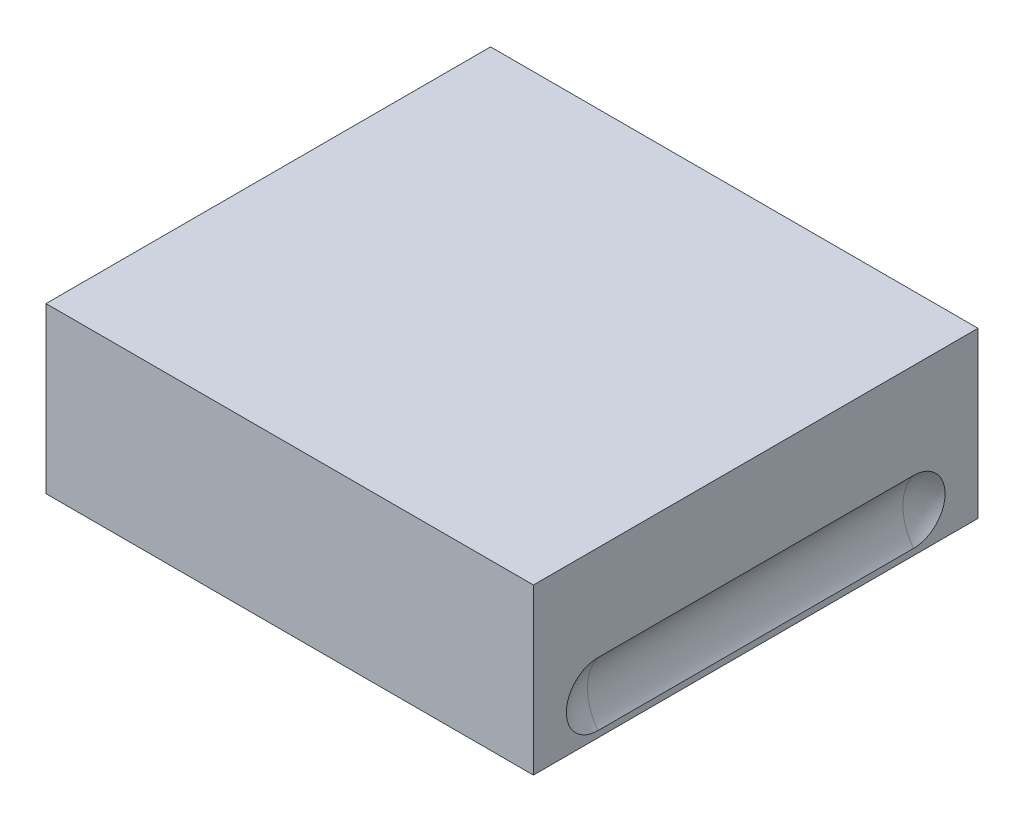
ISO-10303-21;
HEADER;
FILE_DESCRIPTION(('STEP AP214'),'2;1');
FILE_NAME('part.step','',(''),(''),'','','');
FILE_SCHEMA(('AUTOMOTIVE_DESIGN { 1 0 10303 214 1 1 1 1 }'));
ENDSEC;
DATA;
#1=APPLICATION_CONTEXT('core data for automotive mechanical design processes');
#2=APPLICATION_PROTOCOL_DEFINITION('international standard','automotive_design',2000,#1);
#3=PRODUCT_CONTEXT('',#1,'mechanical');
#4=PRODUCT('Part','Part','',(#3));
#5=PRODUCT_RELATED_PRODUCT_CATEGORY('part','',(#4));
#6=PRODUCT_DEFINITION_FORMATION('','',#4);
#7=PRODUCT_DEFINITION_CONTEXT('part definition',#1,'design');
#8=PRODUCT_DEFINITION('design','',#6,#7);
#9=PRODUCT_DEFINITION_SHAPE('','',#8);
#10=(LENGTH_UNIT() NAMED_UNIT(*) SI_UNIT(.MILLI.,.METRE.));
#11=(NAMED_UNIT(*) PLANE_ANGLE_UNIT() SI_UNIT($,.RADIAN.));
#12=(NAMED_UNIT(*) SI_UNIT($,.STERADIAN.) SOLID_ANGLE_UNIT());
#13=UNCERTAINTY_MEASURE_WITH_UNIT(LENGTH_MEASURE(1.E-05),#10,'distance_accuracy_value','');
#14=(GEOMETRIC_REPRESENTATION_CONTEXT(3) GLOBAL_UNCERTAINTY_ASSIGNED_CONTEXT((#13)) GLOBAL_UNIT_ASSIGNED_CONTEXT((#10,
#11,#12)) REPRESENTATION_CONTEXT('',''));
#15=CARTESIAN_POINT('',(0.,0.,0.));
#16=DIRECTION('',(0.,0.,1.));
#17=DIRECTION('',(1.,0.,0.));
#18=AXIS2_PLACEMENT_3D('',#15,#16,#17);
#19=CARTESIAN_POINT('',(0.,82.,-122.5));
#20=DIRECTION('',(0.,1.,0.));
#21=DIRECTION('',(0.,0.,1.));
#22=AXIS2_PLACEMENT_3D('',#19,#20,#21);
#23=PLANE('',#22);
#24=DIRECTION('',(1.,0.,0.));
#25=VECTOR('',#24,1.);
#26=CARTESIAN_POINT('',(23.5,82.,-81.5));
#27=LINE('',#26,#25);
#28=CARTESIAN_POINT('',(23.5,82.,-81.5));
#29=VERTEX_POINT('',#28);
#30=CARTESIAN_POINT('',(-23.5,82.,-81.5));
#31=VERTEX_POINT('',#30);
#32=EDGE_CURVE('E272',#29,#31,#27,.F.);
#33=ORIENTED_EDGE('',*,*,#32,.T.);
#34=DIRECTION('',(0.,0.,1.));
#35=VECTOR('',#34,1.);
#36=CARTESIAN_POINT('',(-23.5,82.,-81.5));
#37=LINE('',#36,#35);
#38=CARTESIAN_POINT('',(-23.5,82.,-163.5));
#39=VERTEX_POINT('',#38);
#40=EDGE_CURVE('E271',#31,#39,#37,.F.);
#41=ORIENTED_EDGE('',*,*,#40,.T.);
#42=DIRECTION('',(-1.,0.,0.));
#43=VECTOR('',#42,1.);
#44=CARTESIAN_POINT('',(-23.5,82.,-163.5));
#45=LINE('',#44,#43);
#46=CARTESIAN_POINT('',(23.5,82.,-163.5));
#47=VERTEX_POINT('',#46);
#48=EDGE_CURVE('E279',#39,#47,#45,.F.);
#49=ORIENTED_EDGE('',*,*,#48,.T.);
#50=DIRECTION('',(0.,0.,-1.));
#51=VECTOR('',#50,1.);
#52=CARTESIAN_POINT('',(23.5,82.,-163.5));
#53=LINE('',#52,#51);
#54=EDGE_CURVE('E80',#47,#29,#53,.F.);
#55=ORIENTED_EDGE('',*,*,#54,.T.);
#56=EDGE_LOOP('',(#33,#41,#49,#55));
#57=FACE_BOUND('',#56,.T.);
#58=ADVANCED_FACE('F14',(#57),#23,.F.);
#59=CARTESIAN_POINT('',(23.5,70.,-81.5));
#60=DIRECTION('',(0.,0.,1.));
#61=DIRECTION('',(1.,0.,0.));
#62=AXIS2_PLACEMENT_3D('',#59,#60,#61);
#63=PLANE('',#62);
#64=DIRECTION('',(0.,1.,0.));
#65=VECTOR('',#64,1.);
#66=CARTESIAN_POINT('',(23.5,70.,-81.5));
#67=LINE('',#66,#65);
#68=CARTESIAN_POINT('',(23.5,70.,-81.5));
#69=VERTEX_POINT('',#68);
#70=EDGE_CURVE('E250',#29,#69,#67,.F.);
#71=ORIENTED_EDGE('',*,*,#70,.T.);
#72=DIRECTION('',(1.,0.,0.));
#73=VECTOR('',#72,1.);
#74=CARTESIAN_POINT('',(0.,70.,-81.5));
#75=LINE('',#74,#73);
#76=CARTESIAN_POINT('',(-23.5,70.,-81.5));
#77=VERTEX_POINT('',#76);
#78=EDGE_CURVE('E218',#69,#77,#75,.F.);
#79=ORIENTED_EDGE('',*,*,#78,.T.);
#80=DIRECTION('',(0.,1.,0.));
#81=VECTOR('',#80,1.);
#82=CARTESIAN_POINT('',(-23.5,70.,-81.5));
#83=LINE('',#82,#81);
#84=EDGE_CURVE('E263',#77,#31,#83,.T.);
#85=ORIENTED_EDGE('',*,*,#84,.T.);
#86=ORIENTED_EDGE('',*,*,#32,.F.);
#87=EDGE_LOOP('',(#71,#79,#85,#86));
#88=FACE_BOUND('',#87,.T.);
#89=ADVANCED_FACE('F260',(#88),#63,.F.);
#90=CARTESIAN_POINT('',(-23.5,70.,-81.5));
#91=DIRECTION('',(-1.,0.,0.));
#92=DIRECTION('',(0.,0.,1.));
#93=AXIS2_PLACEMENT_3D('',#90,#91,#92);
#94=PLANE('',#93);
#95=ORIENTED_EDGE('',*,*,#84,.F.);
#96=DIRECTION('',(0.,0.,1.));
#97=VECTOR('',#96,1.);
#98=CARTESIAN_POINT('',(-23.5,70.,-122.5));
#99=LINE('',#98,#97);
#100=CARTESIAN_POINT('',(-23.5,70.,-163.5));
#101=VERTEX_POINT('',#100);
#102=EDGE_CURVE('E221',#77,#101,#99,.F.);
#103=ORIENTED_EDGE('',*,*,#102,.T.);
#104=DIRECTION('',(0.,1.,0.));
#105=VECTOR('',#104,1.);
#106=CARTESIAN_POINT('',(-23.5,70.,-163.5));
#107=LINE('',#106,#105);
#108=EDGE_CURVE('E274',#101,#39,#107,.T.);
#109=ORIENTED_EDGE('',*,*,#108,.T.);
#110=ORIENTED_EDGE('',*,*,#40,.F.);
#111=EDGE_LOOP('',(#95,#103,#109,#110));
#112=FACE_BOUND('',#111,.T.);
#113=ADVANCED_FACE('F268',(#112),#94,.F.);
#114=CARTESIAN_POINT('',(-23.5,70.,-163.5));
#115=DIRECTION('',(0.,0.,-1.));
#116=DIRECTION('',(-1.,0.,0.));
#117=AXIS2_PLACEMENT_3D('',#114,#115,#116);
#118=PLANE('',#117);
#119=ORIENTED_EDGE('',*,*,#108,.F.);
#120=DIRECTION('',(1.,0.,0.));
#121=VECTOR('',#120,1.);
#122=CARTESIAN_POINT('',(0.,70.,-163.5));
#123=LINE('',#122,#121);
#124=CARTESIAN_POINT('',(23.5,70.,-163.5));
#125=VERTEX_POINT('',#124);
#126=EDGE_CURVE('E233',#101,#125,#123,.T.);
#127=ORIENTED_EDGE('',*,*,#126,.T.);
#128=DIRECTION('',(0.,1.,0.));
#129=VECTOR('',#128,1.);
#130=CARTESIAN_POINT('',(23.5,70.,-163.5));
#131=LINE('',#130,#129);
#132=EDGE_CURVE('E251',#125,#47,#131,.T.);
#133=ORIENTED_EDGE('',*,*,#132,.T.);
#134=ORIENTED_EDGE('',*,*,#48,.F.);
#135=EDGE_LOOP('',(#119,#127,#133,#134));
#136=FACE_BOUND('',#135,.T.);
#137=ADVANCED_FACE('F288',(#136),#118,.F.);
#138=CARTESIAN_POINT('',(23.5,70.,-163.5));
#139=DIRECTION('',(1.,0.,0.));
#140=DIRECTION('',(0.,0.,-1.));
#141=AXIS2_PLACEMENT_3D('',#138,#139,#140);
#142=PLANE('',#141);
#143=ORIENTED_EDGE('',*,*,#132,.F.);
#144=DIRECTION('',(0.,0.,1.));
#145=VECTOR('',#144,1.);
#146=CARTESIAN_POINT('',(23.5,70.,-122.5));
#147=LINE('',#146,#145);
#148=EDGE_CURVE('E93',#125,#69,#147,.T.);
#149=ORIENTED_EDGE('',*,*,#148,.T.);
#150=ORIENTED_EDGE('',*,*,#70,.F.);
#151=ORIENTED_EDGE('',*,*,#54,.F.);
#152=EDGE_LOOP('',(#143,#149,#150,#151));
#153=FACE_BOUND('',#152,.T.);
#154=ADVANCED_FACE('F246',(#153),#142,.F.);
#155=CARTESIAN_POINT('',(86.8,81.5,-74.5999999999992));
#156=DIRECTION('',(0.197358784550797,0.257587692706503,0.945884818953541));
#157=DIRECTION('',(0.615894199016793,-0.783252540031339,0.0847926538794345));
#158=AXIS2_PLACEMENT_3D('',#155,#156,#157);
#159=SPHERICAL_SURFACE('',#158,16.);
#160=CARTESIAN_POINT('',(86.8,81.5,-74.6));
#161=DIRECTION('',(0.,0.,1.));
#162=DIRECTION('',(1.,0.,0.));
#163=AXIS2_PLACEMENT_3D('',#160,#161,#162);
#164=CIRCLE('',#163,16.);
#165=CARTESIAN_POINT('',(74.,71.9,-74.6));
#166=VERTEX_POINT('',#165);
#167=CARTESIAN_POINT('',(74.,91.1,-74.6));
#168=VERTEX_POINT('',#167);
#169=EDGE_CURVE('E18',#166,#168,#164,.F.);
#170=ORIENTED_EDGE('',*,*,#169,.T.);
#171=CARTESIAN_POINT('',(74.,71.9000000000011,-74.6));
#172=CARTESIAN_POINT('',(74.,71.8999709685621,-74.329996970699));
#173=CARTESIAN_POINT('',(74.,71.9113896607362,-74.0599981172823));
#174=CARTESIAN_POINT('',(74.,71.9569128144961,-73.5219320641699));
#175=CARTESIAN_POINT('',(74.,71.9910161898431,-73.2538647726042));
#176=CARTESIAN_POINT('',(74.,72.0816671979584,-72.7217460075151));
#177=CARTESIAN_POINT('',(74.,72.1381990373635,-72.4576918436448));
#178=CARTESIAN_POINT('',(74.,72.2732956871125,-71.9352849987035));
#179=CARTESIAN_POINT('',(74.,72.35186022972,-71.6769322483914));
#180=CARTESIAN_POINT('',(74.,72.5305080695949,-71.1676431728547));
#181=CARTESIAN_POINT('',(74.,72.6306012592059,-70.9167103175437));
#182=CARTESIAN_POINT('',(74.,72.8515750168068,-70.4241642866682));
#183=CARTESIAN_POINT('',(74.,72.9724560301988,-70.1825513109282));
#184=CARTESIAN_POINT('',(74.,73.2341176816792,-69.7104172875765));
#185=CARTESIAN_POINT('',(74.,73.3748942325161,-69.4798939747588));
#186=CARTESIAN_POINT('',(74.,73.6753642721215,-69.031525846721));
#187=CARTESIAN_POINT('',(74.,73.8350576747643,-68.8136809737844));
#188=CARTESIAN_POINT('',(74.,74.1722327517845,-68.3922096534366));
#189=CARTESIAN_POINT('',(74.,74.3497150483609,-68.1885837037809));
#190=CARTESIAN_POINT('',(74.,74.7211976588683,-67.7970102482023));
#191=CARTESIAN_POINT('',(74.,74.9151976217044,-67.6090624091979));
#192=CARTESIAN_POINT('',(74.,75.3183728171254,-67.2501469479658));
#193=CARTESIAN_POINT('',(74.,75.5275505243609,-67.0791821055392));
#194=CARTESIAN_POINT('',(74.,75.9595657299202,-66.7554832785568));
#195=CARTESIAN_POINT('',(74.,76.1824032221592,-66.6027492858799));
#196=CARTESIAN_POINT('',(74.,76.6401435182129,-66.31660437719));
#197=CARTESIAN_POINT('',(74.,76.8750457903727,-66.1831926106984));
#198=CARTESIAN_POINT('',(74.,77.3552545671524,-65.9366326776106));
#199=CARTESIAN_POINT('',(74.,77.6005610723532,-65.8234845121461));
#200=CARTESIAN_POINT('',(74.,78.0998181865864,-65.6182628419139));
#201=CARTESIAN_POINT('',(74.,78.3537682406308,-65.5261879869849));
#202=CARTESIAN_POINT('',(74.,78.8685220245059,-65.3637582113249));
#203=CARTESIAN_POINT('',(74.,79.1293257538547,-65.2934032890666));
#204=CARTESIAN_POINT('',(74.,79.6559382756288,-65.1749123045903));
#205=CARTESIAN_POINT('',(74.,79.9217471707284,-65.1267766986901));
#206=CARTESIAN_POINT('',(74.,80.4564751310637,-65.0530686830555));
#207=CARTESIAN_POINT('',(74.,80.7253941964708,-65.027496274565));
#208=CARTESIAN_POINT('',(74.,81.2644368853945,-64.9990961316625));
#209=CARTESIAN_POINT('',(74.,81.5345605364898,-64.9962689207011));
#210=CARTESIAN_POINT('',(74.,82.0740857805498,-65.0133806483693));
#211=CARTESIAN_POINT('',(74.,82.3434873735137,-65.0333195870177));
#212=CARTESIAN_POINT('',(74.,82.8796505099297,-65.0958215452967));
#213=CARTESIAN_POINT('',(74.,83.1464120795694,-65.1383843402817));
#214=CARTESIAN_POINT('',(74.,83.6754013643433,-65.2458312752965));
#215=CARTESIAN_POINT('',(74.,83.9376290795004,-65.310715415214));
#216=CARTESIAN_POINT('',(74.,84.4556855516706,-65.4623435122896));
#217=CARTESIAN_POINT('',(74.,84.7115143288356,-65.5490874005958));
#218=CARTESIAN_POINT('',(74.,85.2149549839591,-65.7438183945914));
#219=CARTESIAN_POINT('',(74.,85.4625668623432,-65.8518054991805));
#220=CARTESIAN_POINT('',(74.,85.9478197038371,-66.0882582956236));
#221=CARTESIAN_POINT('',(74.,86.1854604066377,-66.2167245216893));
#222=CARTESIAN_POINT('',(74.,86.6490745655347,-66.4932202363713));
#223=CARTESIAN_POINT('',(74.,86.8750480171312,-66.641249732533));
#224=CARTESIAN_POINT('',(74.,87.3137102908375,-66.9558118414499));
#225=CARTESIAN_POINT('',(74.,87.526399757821,-67.1223435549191));
#226=CARTESIAN_POINT('',(74.,87.9369936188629,-67.472731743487));
#227=CARTESIAN_POINT('',(74.,88.1348980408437,-67.6565881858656));
#228=CARTESIAN_POINT('',(74.,88.5144879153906,-68.0402913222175));
#229=CARTESIAN_POINT('',(74.,88.6961757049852,-68.2401357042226));
#230=CARTESIAN_POINT('',(74.,89.0420768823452,-68.654421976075));
#231=CARTESIAN_POINT('',(74.,89.2062898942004,-68.868864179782));
#232=CARTESIAN_POINT('',(74.,89.5161199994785,-69.3108895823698));
#233=CARTESIAN_POINT('',(74.,89.6617310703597,-69.5384770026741));
#234=CARTESIAN_POINT('',(74.,89.9332554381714,-70.0051042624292));
#235=CARTESIAN_POINT('',(74.,90.0591693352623,-70.2441437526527));
#236=CARTESIAN_POINT('',(74.,90.2904830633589,-70.7321367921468));
#237=CARTESIAN_POINT('',(74.,90.3958697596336,-70.9810965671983));
#238=CARTESIAN_POINT('',(74.,90.5852761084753,-71.4870096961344));
#239=CARTESIAN_POINT('',(74.,90.6692963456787,-71.7439628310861));
#240=CARTESIAN_POINT('',(74.,90.815281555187,-72.2636985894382));
#241=CARTESIAN_POINT('',(74.,90.8772745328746,-72.526473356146));
#242=CARTESIAN_POINT('',(74.,90.9788912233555,-73.0562053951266));
#243=CARTESIAN_POINT('',(74.,91.0185259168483,-73.3231605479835));
#244=CARTESIAN_POINT('',(74.,91.0645706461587,-73.758913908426));
#245=CARTESIAN_POINT('',(74.,91.0778651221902,-73.9270145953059));
#246=CARTESIAN_POINT('',(74.,91.0955734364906,-74.2634043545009));
#247=CARTESIAN_POINT('',(74.,91.100001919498,-74.4316926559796));
#248=CARTESIAN_POINT('',(74.,91.0999999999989,-74.6));
#249=B_SPLINE_CURVE_WITH_KNOTS('',3,(#171,#172,#173,#174,#175,#176,#177,#178,#179,#180,#181,
#182,#183,#184,#185,#186,#187,#188,#189,#190,#191,#192,#193,#194,#195,#196,#197,#198,#199,#200,
#201,#202,#203,#204,#205,#206,#207,#208,#209,#210,#211,#212,#213,#214,#215,#216,#217,#218,#219,
#220,#221,#222,#223,#224,#225,#226,#227,#228,#229,#230,#231,#232,#233,#234,#235,#236,#237,#238,
#239,#240,#241,#242,#243,#244,#245,#246,#247,#248),.UNSPECIFIED.,.F.,.F.,(4,2,2,2,2,2,2,2,2,2,2,
2,2,2,2,2,2,2,2,2,2,2,2,2,2,2,2,2,2,2,2,2,2,2,2,2,2,2,4),(0.,0.809761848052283,1.61948492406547,
2.42863882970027,3.23778290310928,4.04729957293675,4.85683358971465,5.66620154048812,
6.47556580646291,7.2849583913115,8.09433377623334,8.90384142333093,9.71334870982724,
10.5228203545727,11.332292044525,12.1417118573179,12.9511316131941,13.7605679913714,
14.5700044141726,15.3794594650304,16.1889145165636,16.9983615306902,17.8078085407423,
18.6172530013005,19.4266974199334,20.2361629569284,21.0456288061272,21.8550553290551,
22.6644803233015,23.4737884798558,24.2831140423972,25.0927009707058,25.90226322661,
26.7123418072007,27.5223982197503,28.3314210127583,29.1400461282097,29.6457079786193,
30.1505338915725),.UNSPECIFIED.);
#250=EDGE_CURVE('E77',#166,#168,#249,.T.);
#251=ORIENTED_EDGE('',*,*,#250,.F.);
#252=EDGE_LOOP('',(#170,#251));
#253=FACE_BOUND('',#252,.T.);
#254=ADVANCED_FACE('F75',(#253),#159,.F.);
#255=CARTESIAN_POINT('',(86.8,81.5,-122.5));
#256=DIRECTION('',(0.,0.,1.));
#257=DIRECTION('',(1.,0.,0.));
#258=AXIS2_PLACEMENT_3D('',#255,#256,#257);
#259=CYLINDRICAL_SURFACE('',#258,16.);
#260=ORIENTED_EDGE('',*,*,#169,.F.);
#261=DIRECTION('',(0.,0.,-1.));
#262=VECTOR('',#261,1.);
#263=CARTESIAN_POINT('',(74.,71.9,-190.));
#264=LINE('',#263,#262);
#265=CARTESIAN_POINT('',(74.,71.9,-170.4));
#266=VERTEX_POINT('',#265);
#267=EDGE_CURVE('E91',#266,#166,#264,.F.);
#268=ORIENTED_EDGE('',*,*,#267,.F.);
#269=CARTESIAN_POINT('',(86.8,81.5,-170.4));
#270=DIRECTION('',(0.,0.,1.));
#271=DIRECTION('',(1.,0.,0.));
#272=AXIS2_PLACEMENT_3D('',#269,#270,#271);
#273=CIRCLE('',#272,16.);
#274=CARTESIAN_POINT('',(74.,91.1,-170.4));
#275=VERTEX_POINT('',#274);
#276=EDGE_CURVE('E79',#266,#275,#273,.F.);
#277=ORIENTED_EDGE('',*,*,#276,.T.);
#278=DIRECTION('',(0.,0.,-1.));
#279=VECTOR('',#278,1.);
#280=CARTESIAN_POINT('',(74.,91.1,-190.));
#281=LINE('',#280,#279);
#282=EDGE_CURVE('E82',#168,#275,#281,.T.);
#283=ORIENTED_EDGE('',*,*,#282,.F.);
#284=EDGE_LOOP('',(#260,#268,#277,#283));
#285=FACE_BOUND('',#284,.T.);
#286=ADVANCED_FACE('F83',(#285),#259,.F.);
#287=CARTESIAN_POINT('',(86.8,81.5,-170.4));
#288=DIRECTION('',(0.197358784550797,0.257587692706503,0.945884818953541));
#289=DIRECTION('',(0.615894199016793,-0.783252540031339,0.0847926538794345));
#290=AXIS2_PLACEMENT_3D('',#287,#288,#289);
#291=SPHERICAL_SURFACE('',#290,16.);
#292=ORIENTED_EDGE('',*,*,#276,.F.);
#293=CARTESIAN_POINT('',(74.,91.0999999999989,-170.4));
#294=CARTESIAN_POINT('',(74.,91.1000290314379,-170.670003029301));
#295=CARTESIAN_POINT('',(74.,91.0886103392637,-170.940001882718));
#296=CARTESIAN_POINT('',(74.,91.0430871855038,-171.47806793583));
#297=CARTESIAN_POINT('',(74.,91.0089838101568,-171.746135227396));
#298=CARTESIAN_POINT('',(74.,90.9183328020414,-172.278253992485));
#299=CARTESIAN_POINT('',(74.,90.8618009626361,-172.542308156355));
#300=CARTESIAN_POINT('',(74.,90.7267043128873,-173.064715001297));
#301=CARTESIAN_POINT('',(74.,90.64813977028,-173.323067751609));
#302=CARTESIAN_POINT('',(74.,90.4694919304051,-173.832356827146));
#303=CARTESIAN_POINT('',(74.,90.3693987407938,-174.083289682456));
#304=CARTESIAN_POINT('',(74.,90.1484249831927,-174.575835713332));
#305=CARTESIAN_POINT('',(74.,90.0275439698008,-174.817448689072));
#306=CARTESIAN_POINT('',(74.,89.7658823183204,-175.289582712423));
#307=CARTESIAN_POINT('',(74.,89.6251057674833,-175.520106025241));
#308=CARTESIAN_POINT('',(74.,89.3246357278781,-175.968474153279));
#309=CARTESIAN_POINT('',(74.,89.1649423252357,-176.186319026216));
#310=CARTESIAN_POINT('',(74.,88.8277672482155,-176.607790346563));
#311=CARTESIAN_POINT('',(74.,88.6502849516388,-176.811416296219));
#312=CARTESIAN_POINT('',(74.,88.2788023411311,-177.202989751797));
#313=CARTESIAN_POINT('',(74.,88.0848023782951,-177.390937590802));
#314=CARTESIAN_POINT('',(74.,87.6816271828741,-177.749853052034));
#315=CARTESIAN_POINT('',(74.,87.4724494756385,-177.92081789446));
#316=CARTESIAN_POINT('',(74.,87.0404342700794,-178.244516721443));
#317=CARTESIAN_POINT('',(74.,86.8175967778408,-178.39725071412));
#318=CARTESIAN_POINT('',(74.,86.3598564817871,-178.68339562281));
#319=CARTESIAN_POINT('',(74.,86.124954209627,-178.816807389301));
#320=CARTESIAN_POINT('',(74.,85.6447454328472,-179.063367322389));
#321=CARTESIAN_POINT('',(74.,85.3994389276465,-179.176515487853));
#322=CARTESIAN_POINT('',(74.,84.9001818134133,-179.381737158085));
#323=CARTESIAN_POINT('',(74.,84.6462317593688,-179.473812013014));
#324=CARTESIAN_POINT('',(74.,84.1314779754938,-179.636241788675));
#325=CARTESIAN_POINT('',(74.,83.8706742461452,-179.706596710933));
#326=CARTESIAN_POINT('',(74.,83.3440617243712,-179.82508769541));
#327=CARTESIAN_POINT('',(74.,83.0782528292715,-179.873223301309));
#328=CARTESIAN_POINT('',(74.,82.5435248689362,-179.946931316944));
#329=CARTESIAN_POINT('',(74.,82.2746058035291,-179.972503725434));
#330=CARTESIAN_POINT('',(74.,81.7355631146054,-180.000903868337));
#331=CARTESIAN_POINT('',(74.,81.4654394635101,-180.003731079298));
#332=CARTESIAN_POINT('',(74.,80.9259142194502,-179.98661935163));
#333=CARTESIAN_POINT('',(74.,80.6565126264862,-179.966680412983));
#334=CARTESIAN_POINT('',(74.,80.1203494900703,-179.904178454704));
#335=CARTESIAN_POINT('',(74.,79.8535879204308,-179.861615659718));
#336=CARTESIAN_POINT('',(74.,79.324598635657,-179.754168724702));
#337=CARTESIAN_POINT('',(74.,79.0623709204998,-179.689284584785));
#338=CARTESIAN_POINT('',(74.,78.5443144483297,-179.53765648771));
#339=CARTESIAN_POINT('',(74.,78.2884856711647,-179.450912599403));
#340=CARTESIAN_POINT('',(74.,77.785045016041,-179.256181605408));
#341=CARTESIAN_POINT('',(74.,77.5374331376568,-179.148194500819));
#342=CARTESIAN_POINT('',(74.,77.052180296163,-178.911741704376));
#343=CARTESIAN_POINT('',(74.,76.8145395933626,-178.78327547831));
#344=CARTESIAN_POINT('',(74.,76.3509254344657,-178.506779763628));
#345=CARTESIAN_POINT('',(74.,76.1249519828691,-178.358750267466));
#346=CARTESIAN_POINT('',(74.,75.6862897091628,-178.04418815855));
#347=CARTESIAN_POINT('',(74.,75.4736002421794,-177.87765644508));
#348=CARTESIAN_POINT('',(74.,75.0630063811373,-177.527268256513));
#349=CARTESIAN_POINT('',(74.,74.8651019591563,-177.343411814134));
#350=CARTESIAN_POINT('',(74.,74.4855120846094,-176.959708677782));
#351=CARTESIAN_POINT('',(74.,74.3038242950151,-176.759864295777));
#352=CARTESIAN_POINT('',(74.,73.9579231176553,-176.345578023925));
#353=CARTESIAN_POINT('',(74.,73.7937101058,-176.131135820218));
#354=CARTESIAN_POINT('',(74.,73.4838800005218,-175.68911041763));
#355=CARTESIAN_POINT('',(74.,73.3382689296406,-175.461522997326));
#356=CARTESIAN_POINT('',(74.,73.0667445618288,-174.994895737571));
#357=CARTESIAN_POINT('',(74.,72.9408306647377,-174.755856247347));
#358=CARTESIAN_POINT('',(74.,72.709516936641,-174.267863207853));
#359=CARTESIAN_POINT('',(74.,72.6041302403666,-174.018903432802));
#360=CARTESIAN_POINT('',(74.,72.4147238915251,-173.512990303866));
#361=CARTESIAN_POINT('',(74.,72.3307036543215,-173.256037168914));
#362=CARTESIAN_POINT('',(74.,72.1847184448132,-172.736301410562));
#363=CARTESIAN_POINT('',(74.,72.1227254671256,-172.473526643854));
#364=CARTESIAN_POINT('',(74.,72.0211087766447,-171.943794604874));
#365=CARTESIAN_POINT('',(74.,71.9814740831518,-171.676839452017));
#366=CARTESIAN_POINT('',(74.,71.9354293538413,-171.241086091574));
#367=CARTESIAN_POINT('',(74.,71.9221348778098,-171.072985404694));
#368=CARTESIAN_POINT('',(74.,71.9044265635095,-170.736595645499));
#369=CARTESIAN_POINT('',(74.,71.899998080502,-170.56830734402));
#370=CARTESIAN_POINT('',(74.,71.9000000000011,-170.4));
#371=B_SPLINE_CURVE_WITH_KNOTS('',3,(#293,#294,#295,#296,#297,#298,#299,#300,#301,#302,#303,
#304,#305,#306,#307,#308,#309,#310,#311,#312,#313,#314,#315,#316,#317,#318,#319,#320,#321,#322,
#323,#324,#325,#326,#327,#328,#329,#330,#331,#332,#333,#334,#335,#336,#337,#338,#339,#340,#341,
#342,#343,#344,#345,#346,#347,#348,#349,#350,#351,#352,#353,#354,#355,#356,#357,#358,#359,#360,
#361,#362,#363,#364,#365,#366,#367,#368,#369,#370),.UNSPECIFIED.,.F.,.F.,(4,2,2,2,2,2,2,2,2,2,2,
2,2,2,2,2,2,2,2,2,2,2,2,2,2,2,2,2,2,2,2,2,2,2,2,2,2,2,4),(0.,0.809761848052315,1.61948492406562,
2.42863882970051,3.23778290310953,4.0472995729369,4.85683358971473,5.66620154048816,
6.47556580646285,7.2849583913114,8.09433377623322,8.90384142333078,9.71334870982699,
10.5228203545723,11.3322920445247,12.1417118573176,12.9511316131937,13.7605679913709,
14.5700044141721,15.3794594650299,16.1889145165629,16.9983615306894,17.8078085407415,
18.6172530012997,19.4266974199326,20.2361629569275,21.0456288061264,21.8550553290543,
22.6644803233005,23.4737884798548,24.2831140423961,25.0927009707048,25.9022632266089,
26.7123418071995,27.522398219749,28.331421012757,29.1400461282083,29.645707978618,
30.1505338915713),.UNSPECIFIED.);
#372=EDGE_CURVE('E88',#275,#266,#371,.T.);
#373=ORIENTED_EDGE('',*,*,#372,.F.);
#374=EDGE_LOOP('',(#292,#373));
#375=FACE_BOUND('',#374,.T.);
#376=ADVANCED_FACE('F154',(#375),#291,.F.);
#377=CARTESIAN_POINT('',(-86.8,81.5,-170.4));
#378=DIRECTION('',(0.197358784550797,0.257587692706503,0.945884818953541));
#379=DIRECTION('',(0.615894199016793,-0.783252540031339,0.0847926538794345));
#380=AXIS2_PLACEMENT_3D('',#377,#378,#379);
#381=SPHERICAL_SURFACE('',#380,16.);
#382=CARTESIAN_POINT('',(-86.8,81.5,-170.4));
#383=DIRECTION('',(0.,0.,-1.));
#384=DIRECTION('',(-1.,0.,0.));
#385=AXIS2_PLACEMENT_3D('',#382,#383,#384);
#386=CIRCLE('',#385,16.);
#387=CARTESIAN_POINT('',(-74.,71.9,-170.4));
#388=VERTEX_POINT('',#387);
#389=CARTESIAN_POINT('',(-74.,91.1,-170.4));
#390=VERTEX_POINT('',#389);
#391=EDGE_CURVE('E219',#388,#390,#386,.F.);
#392=ORIENTED_EDGE('',*,*,#391,.T.);
#393=CARTESIAN_POINT('',(-74.,71.9000000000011,-170.4));
#394=CARTESIAN_POINT('',(-74.,71.8999709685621,-170.670003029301));
#395=CARTESIAN_POINT('',(-74.,71.9113896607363,-170.940001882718));
#396=CARTESIAN_POINT('',(-74.,71.9569128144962,-171.47806793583));
#397=CARTESIAN_POINT('',(-74.,71.9910161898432,-171.746135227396));
#398=CARTESIAN_POINT('',(-74.,72.0816671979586,-172.278253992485));
#399=CARTESIAN_POINT('',(-74.,72.1381990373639,-172.542308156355));
#400=CARTESIAN_POINT('',(-74.,72.2732956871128,-173.064715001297));
#401=CARTESIAN_POINT('',(-74.,72.35186022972,-173.323067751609));
#402=CARTESIAN_POINT('',(-74.,72.5305080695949,-173.832356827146));
#403=CARTESIAN_POINT('',(-74.,72.6306012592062,-174.083289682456));
#404=CARTESIAN_POINT('',(-74.,72.8515750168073,-174.575835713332));
#405=CARTESIAN_POINT('',(-74.,72.9724560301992,-174.817448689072));
#406=CARTESIAN_POINT('',(-74.,73.2341176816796,-175.289582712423));
#407=CARTESIAN_POINT('',(-74.,73.3748942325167,-175.520106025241));
#408=CARTESIAN_POINT('',(-74.,73.6753642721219,-175.968474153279));
#409=CARTESIAN_POINT('',(-74.,73.8350576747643,-176.186319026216));
#410=CARTESIAN_POINT('',(-74.,74.1722327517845,-176.607790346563));
#411=CARTESIAN_POINT('',(-74.,74.3497150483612,-176.811416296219));
#412=CARTESIAN_POINT('',(-74.,74.7211976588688,-177.202989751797));
#413=CARTESIAN_POINT('',(-74.,74.9151976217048,-177.390937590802));
#414=CARTESIAN_POINT('',(-74.,75.3183728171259,-177.749853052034));
#415=CARTESIAN_POINT('',(-74.,75.5275505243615,-177.92081789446));
#416=CARTESIAN_POINT('',(-74.,75.9595657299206,-178.244516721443));
#417=CARTESIAN_POINT('',(-74.,76.1824032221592,-178.39725071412));
#418=CARTESIAN_POINT('',(-74.,76.6401435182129,-178.68339562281));
#419=CARTESIAN_POINT('',(-74.,76.875045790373,-178.816807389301));
#420=CARTESIAN_POINT('',(-74.,77.3552545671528,-179.063367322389));
#421=CARTESIAN_POINT('',(-74.,77.6005610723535,-179.176515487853));
#422=CARTESIAN_POINT('',(-74.,78.0998181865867,-179.381737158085));
#423=CARTESIAN_POINT('',(-74.,78.3537682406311,-179.473812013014));
#424=CARTESIAN_POINT('',(-74.,78.8685220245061,-179.636241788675));
#425=CARTESIAN_POINT('',(-74.,79.1293257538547,-179.706596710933));
#426=CARTESIAN_POINT('',(-74.,79.6559382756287,-179.82508769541));
#427=CARTESIAN_POINT('',(-74.,79.9217471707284,-179.873223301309));
#428=CARTESIAN_POINT('',(-74.,80.4564751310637,-179.946931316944));
#429=CARTESIAN_POINT('',(-74.,80.7253941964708,-179.972503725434));
#430=CARTESIAN_POINT('',(-74.,81.2644368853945,-180.000903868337));
#431=CARTESIAN_POINT('',(-74.,81.5345605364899,-180.003731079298));
#432=CARTESIAN_POINT('',(-74.,82.0740857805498,-179.98661935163));
#433=CARTESIAN_POINT('',(-74.,82.3434873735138,-179.966680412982));
#434=CARTESIAN_POINT('',(-74.,82.8796505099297,-179.904178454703));
#435=CARTESIAN_POINT('',(-74.,83.1464120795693,-179.861615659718));
#436=CARTESIAN_POINT('',(-74.,83.6754013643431,-179.754168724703));
#437=CARTESIAN_POINT('',(-74.,83.9376290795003,-179.689284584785));
#438=CARTESIAN_POINT('',(-74.,84.4556855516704,-179.53765648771));
#439=CARTESIAN_POINT('',(-74.,84.7115143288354,-179.450912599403));
#440=CARTESIAN_POINT('',(-74.,85.214954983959,-179.256181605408));
#441=CARTESIAN_POINT('',(-74.,85.4625668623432,-179.148194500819));
#442=CARTESIAN_POINT('',(-74.,85.947819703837,-178.911741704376));
#443=CARTESIAN_POINT('',(-74.,86.1854604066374,-178.78327547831));
#444=CARTESIAN_POINT('',(-74.,86.6490745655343,-178.506779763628));
#445=CARTESIAN_POINT('',(-74.,86.8750480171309,-178.358750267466));
#446=CARTESIAN_POINT('',(-74.,87.3137102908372,-178.04418815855));
#447=CARTESIAN_POINT('',(-74.,87.5263997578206,-177.87765644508));
#448=CARTESIAN_POINT('',(-74.,87.9369936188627,-177.527268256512));
#449=CARTESIAN_POINT('',(-74.,88.1348980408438,-177.343411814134));
#450=CARTESIAN_POINT('',(-74.,88.5144879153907,-176.959708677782));
#451=CARTESIAN_POINT('',(-74.,88.696175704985,-176.759864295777));
#452=CARTESIAN_POINT('',(-74.,89.0420768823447,-176.345578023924));
#453=CARTESIAN_POINT('',(-74.,89.2062898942,-176.131135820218));
#454=CARTESIAN_POINT('',(-74.,89.5161199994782,-175.68911041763));
#455=CARTESIAN_POINT('',(-74.,89.6617310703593,-175.461522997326));
#456=CARTESIAN_POINT('',(-74.,89.9332554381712,-174.994895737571));
#457=CARTESIAN_POINT('',(-74.,90.0591693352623,-174.755856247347));
#458=CARTESIAN_POINT('',(-74.,90.2904830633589,-174.267863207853));
#459=CARTESIAN_POINT('',(-74.,90.3958697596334,-174.018903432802));
#460=CARTESIAN_POINT('',(-74.,90.5852761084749,-173.512990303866));
#461=CARTESIAN_POINT('',(-74.,90.6692963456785,-173.256037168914));
#462=CARTESIAN_POINT('',(-74.,90.8152815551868,-172.736301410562));
#463=CARTESIAN_POINT('',(-74.,90.8772745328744,-172.473526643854));
#464=CARTESIAN_POINT('',(-74.,90.9788912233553,-171.943794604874));
#465=CARTESIAN_POINT('',(-74.,91.0185259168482,-171.676839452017));
#466=CARTESIAN_POINT('',(-74.,91.0645706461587,-171.241086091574));
#467=CARTESIAN_POINT('',(-74.,91.0778651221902,-171.072985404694));
#468=CARTESIAN_POINT('',(-74.,91.0955734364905,-170.736595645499));
#469=CARTESIAN_POINT('',(-74.,91.100001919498,-170.56830734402));
#470=CARTESIAN_POINT('',(-74.,91.0999999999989,-170.4));
#471=B_SPLINE_CURVE_WITH_KNOTS('',3,(#393,#394,#395,#396,#397,#398,#399,#400,#401,#402,#403,
#404,#405,#406,#407,#408,#409,#410,#411,#412,#413,#414,#415,#416,#417,#418,#419,#420,#421,#422,
#423,#424,#425,#426,#427,#428,#429,#430,#431,#432,#433,#434,#435,#436,#437,#438,#439,#440,#441,
#442,#443,#444,#445,#446,#447,#448,#449,#450,#451,#452,#453,#454,#455,#456,#457,#458,#459,#460,
#461,#462,#463,#464,#465,#466,#467,#468,#469,#470),.UNSPECIFIED.,.F.,.F.,(4,2,2,2,2,2,2,2,2,2,2,
2,2,2,2,2,2,2,2,2,2,2,2,2,2,2,2,2,2,2,2,2,2,2,2,2,2,2,4),(0.,0.809761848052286,1.61948492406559,
2.42863882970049,3.23778290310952,4.04729957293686,4.85683358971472,5.66620154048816,
6.47556580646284,7.28495839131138,8.09433377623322,8.90384142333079,9.71334870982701,
10.5228203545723,11.3322920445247,12.1417118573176,12.9511316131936,13.7605679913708,
14.570004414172,15.3794594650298,16.188914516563,16.9983615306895,17.8078085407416,
18.6172530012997,19.4266974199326,20.2361629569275,21.0456288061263,21.8550553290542,
22.6644803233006,23.4737884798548,24.2831140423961,25.0927009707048,25.9022632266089,
26.7123418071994,27.522398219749,28.3314210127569,29.1400461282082,29.645707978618,
30.1505338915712),.UNSPECIFIED.);
#472=EDGE_CURVE('E139',#388,#390,#471,.T.);
#473=ORIENTED_EDGE('',*,*,#472,.F.);
#474=EDGE_LOOP('',(#392,#473));
#475=FACE_BOUND('',#474,.T.);
#476=ADVANCED_FACE('F148',(#475),#381,.F.);
#477=CARTESIAN_POINT('',(-86.8,81.5,-122.5));
#478=DIRECTION('',(0.,0.,-1.));
#479=DIRECTION('',(-1.,0.,0.));
#480=AXIS2_PLACEMENT_3D('',#477,#478,#479);
#481=CYLINDRICAL_SURFACE('',#480,16.);
#482=ORIENTED_EDGE('',*,*,#391,.F.);
#483=DIRECTION('',(0.,0.,1.));
#484=VECTOR('',#483,1.);
#485=CARTESIAN_POINT('',(-74.,71.9,-55.));
#486=LINE('',#485,#484);
#487=CARTESIAN_POINT('',(-74.,71.9,-74.6));
#488=VERTEX_POINT('',#487);
#489=EDGE_CURVE('E147',#488,#388,#486,.F.);
#490=ORIENTED_EDGE('',*,*,#489,.F.);
#491=CARTESIAN_POINT('',(-86.8,81.5,-74.6));
#492=DIRECTION('',(0.,0.,-1.));
#493=DIRECTION('',(-1.,0.,0.));
#494=AXIS2_PLACEMENT_3D('',#491,#492,#493);
#495=CIRCLE('',#494,16.);
#496=CARTESIAN_POINT('',(-74.,91.1,-74.6));
#497=VERTEX_POINT('',#496);
#498=EDGE_CURVE('E109',#488,#497,#495,.F.);
#499=ORIENTED_EDGE('',*,*,#498,.T.);
#500=DIRECTION('',(0.,0.,1.));
#501=VECTOR('',#500,1.);
#502=CARTESIAN_POINT('',(-74.,91.1,-55.));
#503=LINE('',#502,#501);
#504=EDGE_CURVE('E146',#390,#497,#503,.T.);
#505=ORIENTED_EDGE('',*,*,#504,.F.);
#506=EDGE_LOOP('',(#482,#490,#499,#505));
#507=FACE_BOUND('',#506,.T.);
#508=ADVANCED_FACE('F153',(#507),#481,.F.);
#509=CARTESIAN_POINT('',(-86.8,81.5,-74.5999999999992));
#510=DIRECTION('',(0.197358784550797,0.257587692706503,0.945884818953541));
#511=DIRECTION('',(0.615894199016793,-0.783252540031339,0.0847926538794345));
#512=AXIS2_PLACEMENT_3D('',#509,#510,#511);
#513=SPHERICAL_SURFACE('',#512,16.);
#514=ORIENTED_EDGE('',*,*,#498,.F.);
#515=CARTESIAN_POINT('',(-74.,91.0999999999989,-74.6));
#516=CARTESIAN_POINT('',(-74.,91.1000290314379,-74.329996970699));
#517=CARTESIAN_POINT('',(-74.,91.0886103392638,-74.0599981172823));
#518=CARTESIAN_POINT('',(-74.,91.0430871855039,-73.5219320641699));
#519=CARTESIAN_POINT('',(-74.,91.0089838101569,-73.2538647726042));
#520=CARTESIAN_POINT('',(-74.,90.9183328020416,-72.7217460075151));
#521=CARTESIAN_POINT('',(-74.,90.8618009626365,-72.4576918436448));
#522=CARTESIAN_POINT('',(-74.,90.7267043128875,-71.9352849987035));
#523=CARTESIAN_POINT('',(-74.,90.6481397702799,-71.6769322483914));
#524=CARTESIAN_POINT('',(-74.,90.4694919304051,-71.1676431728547));
#525=CARTESIAN_POINT('',(-74.,90.3693987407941,-70.9167103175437));
#526=CARTESIAN_POINT('',(-74.,90.1484249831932,-70.4241642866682));
#527=CARTESIAN_POINT('',(-74.,90.0275439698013,-70.1825513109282));
#528=CARTESIAN_POINT('',(-74.,89.7658823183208,-69.7104172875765));
#529=CARTESIAN_POINT('',(-74.,89.6251057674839,-69.4798939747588));
#530=CARTESIAN_POINT('',(-74.,89.3246357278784,-69.031525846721));
#531=CARTESIAN_POINT('',(-74.,89.1649423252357,-68.8136809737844));
#532=CARTESIAN_POINT('',(-74.,88.8277672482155,-68.3922096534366));
#533=CARTESIAN_POINT('',(-74.,88.6502849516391,-68.1885837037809));
#534=CARTESIAN_POINT('',(-74.,88.2788023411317,-67.7970102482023));
#535=CARTESIAN_POINT('',(-74.,88.0848023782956,-67.6090624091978));
#536=CARTESIAN_POINT('',(-74.,87.6816271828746,-67.2501469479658));
#537=CARTESIAN_POINT('',(-74.,87.4724494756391,-67.0791821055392));
#538=CARTESIAN_POINT('',(-74.,87.0404342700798,-66.7554832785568));
#539=CARTESIAN_POINT('',(-74.,86.8175967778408,-66.6027492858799));
#540=CARTESIAN_POINT('',(-74.,86.3598564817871,-66.31660437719));
#541=CARTESIAN_POINT('',(-74.,86.1249542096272,-66.1831926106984));
#542=CARTESIAN_POINT('',(-74.,85.6447454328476,-65.9366326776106));
#543=CARTESIAN_POINT('',(-74.,85.3994389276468,-65.8234845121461));
#544=CARTESIAN_POINT('',(-74.,84.9001818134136,-65.6182628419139));
#545=CARTESIAN_POINT('',(-74.,84.6462317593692,-65.5261879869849));
#546=CARTESIAN_POINT('',(-74.,84.1314779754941,-65.3637582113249));
#547=CARTESIAN_POINT('',(-74.,83.8706742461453,-65.2934032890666));
#548=CARTESIAN_POINT('',(-74.,83.3440617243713,-65.1749123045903));
#549=CARTESIAN_POINT('',(-74.,83.0782528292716,-65.1267766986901));
#550=CARTESIAN_POINT('',(-74.,82.5435248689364,-65.0530686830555));
#551=CARTESIAN_POINT('',(-74.,82.2746058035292,-65.027496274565));
#552=CARTESIAN_POINT('',(-74.,81.7355631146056,-64.9990961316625));
#553=CARTESIAN_POINT('',(-74.,81.4654394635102,-64.9962689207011));
#554=CARTESIAN_POINT('',(-74.,80.9259142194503,-65.0133806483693));
#555=CARTESIAN_POINT('',(-74.,80.6565126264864,-65.0333195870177));
#556=CARTESIAN_POINT('',(-74.,80.1203494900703,-65.0958215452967));
#557=CARTESIAN_POINT('',(-74.,79.8535879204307,-65.1383843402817));
#558=CARTESIAN_POINT('',(-74.,79.3245986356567,-65.2458312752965));
#559=CARTESIAN_POINT('',(-74.,79.0623709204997,-65.3107154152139));
#560=CARTESIAN_POINT('',(-74.,78.5443144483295,-65.4623435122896));
#561=CARTESIAN_POINT('',(-74.,78.2884856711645,-65.5490874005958));
#562=CARTESIAN_POINT('',(-74.,77.7850450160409,-65.7438183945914));
#563=CARTESIAN_POINT('',(-74.,77.5374331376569,-65.8518054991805));
#564=CARTESIAN_POINT('',(-74.,77.052180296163,-66.0882582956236));
#565=CARTESIAN_POINT('',(-74.,76.8145395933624,-66.2167245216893));
#566=CARTESIAN_POINT('',(-74.,76.3509254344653,-66.4932202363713));
#567=CARTESIAN_POINT('',(-74.,76.1249519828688,-66.6412497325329));
#568=CARTESIAN_POINT('',(-74.,75.6862897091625,-66.9558118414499));
#569=CARTESIAN_POINT('',(-74.,75.473600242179,-67.1223435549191));
#570=CARTESIAN_POINT('',(-74.,75.0630063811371,-67.4727317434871));
#571=CARTESIAN_POINT('',(-74.,74.8651019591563,-67.6565881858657));
#572=CARTESIAN_POINT('',(-74.,74.4855120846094,-68.0402913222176));
#573=CARTESIAN_POINT('',(-74.,74.3038242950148,-68.2401357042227));
#574=CARTESIAN_POINT('',(-74.,73.9579231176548,-68.6544219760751));
#575=CARTESIAN_POINT('',(-74.,73.7937101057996,-68.8688641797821));
#576=CARTESIAN_POINT('',(-74.,73.4838800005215,-69.3108895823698));
#577=CARTESIAN_POINT('',(-74.,73.3382689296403,-69.5384770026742));
#578=CARTESIAN_POINT('',(-74.,73.0667445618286,-70.0051042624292));
#579=CARTESIAN_POINT('',(-74.,72.9408306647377,-70.2441437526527));
#580=CARTESIAN_POINT('',(-74.,72.709516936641,-70.7321367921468));
#581=CARTESIAN_POINT('',(-74.,72.6041302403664,-70.9810965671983));
#582=CARTESIAN_POINT('',(-74.,72.4147238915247,-71.4870096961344));
#583=CARTESIAN_POINT('',(-74.,72.3307036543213,-71.743962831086));
#584=CARTESIAN_POINT('',(-74.,72.184718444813,-72.2636985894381));
#585=CARTESIAN_POINT('',(-74.,72.1227254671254,-72.526473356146));
#586=CARTESIAN_POINT('',(-74.,72.0211087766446,-73.0562053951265));
#587=CARTESIAN_POINT('',(-74.,71.9814740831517,-73.3231605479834));
#588=CARTESIAN_POINT('',(-74.,71.9354293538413,-73.7589139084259));
#589=CARTESIAN_POINT('',(-74.,71.9221348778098,-73.9270145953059));
#590=CARTESIAN_POINT('',(-74.,71.9044265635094,-74.2634043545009));
#591=CARTESIAN_POINT('',(-74.,71.899998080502,-74.4316926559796));
#592=CARTESIAN_POINT('',(-74.,71.9000000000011,-74.6));
#593=B_SPLINE_CURVE_WITH_KNOTS('',3,(#515,#516,#517,#518,#519,#520,#521,#522,#523,#524,#525,
#526,#527,#528,#529,#530,#531,#532,#533,#534,#535,#536,#537,#538,#539,#540,#541,#542,#543,#544,
#545,#546,#547,#548,#549,#550,#551,#552,#553,#554,#555,#556,#557,#558,#559,#560,#561,#562,#563,
#564,#565,#566,#567,#568,#569,#570,#571,#572,#573,#574,#575,#576,#577,#578,#579,#580,#581,#582,
#583,#584,#585,#586,#587,#588,#589,#590,#591,#592),.UNSPECIFIED.,.F.,.F.,(4,2,2,2,2,2,2,2,2,2,2,
2,2,2,2,2,2,2,2,2,2,2,2,2,2,2,2,2,2,2,2,2,2,2,2,2,2,2,4),(0.,0.809761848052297,1.61948492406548,
2.42863882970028,3.23778290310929,4.04729957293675,4.85683358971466,5.66620154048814,
6.47556580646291,7.28495839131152,8.09433377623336,8.90384142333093,9.71334870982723,
10.5228203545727,11.332292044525,12.1417118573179,12.9511316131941,13.7605679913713,
14.5700044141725,15.3794594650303,16.1889145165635,16.9983615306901,17.8078085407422,
18.6172530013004,19.4266974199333,20.2361629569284,21.0456288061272,21.8550553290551,
22.6644803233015,23.4737884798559,24.2831140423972,25.0927009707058,25.90226322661,
26.7123418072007,27.5223982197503,28.3314210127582,29.1400461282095,29.6457079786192,
30.1505338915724),.UNSPECIFIED.);
#594=EDGE_CURVE('E133',#497,#488,#593,.T.);
#595=ORIENTED_EDGE('',*,*,#594,.F.);
#596=EDGE_LOOP('',(#514,#595));
#597=FACE_BOUND('',#596,.T.);
#598=ADVANCED_FACE('F164',(#597),#513,.F.);
#599=CARTESIAN_POINT('',(0.,70.,-122.5));
#600=DIRECTION('',(0.,1.,0.));
#601=DIRECTION('',(0.,0.,1.));
#602=AXIS2_PLACEMENT_3D('',#599,#600,#601);
#603=PLANE('',#602);
#604=DIRECTION('',(0.,0.,-1.));
#605=VECTOR('',#604,1.);
#606=CARTESIAN_POINT('',(74.,70.,-190.));
#607=LINE('',#606,#605);
#608=CARTESIAN_POINT('',(74.,70.,-55.));
#609=VERTEX_POINT('',#608);
#610=CARTESIAN_POINT('',(74.,70.,-190.));
#611=VERTEX_POINT('',#610);
#612=EDGE_CURVE('E228',#609,#611,#607,.T.);
#613=ORIENTED_EDGE('',*,*,#612,.F.);
#614=DIRECTION('',(1.,0.,0.));
#615=VECTOR('',#614,1.);
#616=CARTESIAN_POINT('',(74.,70.,-55.));
#617=LINE('',#616,#615);
#618=CARTESIAN_POINT('',(-74.,70.,-55.));
#619=VERTEX_POINT('',#618);
#620=EDGE_CURVE('E196',#619,#609,#617,.T.);
#621=ORIENTED_EDGE('',*,*,#620,.F.);
#622=DIRECTION('',(0.,0.,1.));
#623=VECTOR('',#622,1.);
#624=CARTESIAN_POINT('',(-74.,70.,-55.));
#625=LINE('',#624,#623);
#626=CARTESIAN_POINT('',(-74.,70.,-190.));
#627=VERTEX_POINT('',#626);
#628=EDGE_CURVE('E203',#627,#619,#625,.T.);
#629=ORIENTED_EDGE('',*,*,#628,.F.);
#630=DIRECTION('',(-1.,0.,0.));
#631=VECTOR('',#630,1.);
#632=CARTESIAN_POINT('',(-74.,70.,-190.));
#633=LINE('',#632,#631);
#634=EDGE_CURVE('E224',#611,#627,#633,.T.);
#635=ORIENTED_EDGE('',*,*,#634,.F.);
#636=EDGE_LOOP('',(#613,#621,#629,#635));
#637=FACE_BOUND('',#636,.T.);
#638=ORIENTED_EDGE('',*,*,#126,.F.);
#639=ORIENTED_EDGE('',*,*,#102,.F.);
#640=ORIENTED_EDGE('',*,*,#78,.F.);
#641=ORIENTED_EDGE('',*,*,#148,.F.);
#642=EDGE_LOOP('',(#638,#639,#640,#641));
#643=FACE_BOUND('',#642,.T.);
#644=ADVANCED_FACE('F120',(#637,#643),#603,.F.);
#645=CARTESIAN_POINT('',(74.,70.,-190.));
#646=DIRECTION('',(1.,0.,0.));
#647=DIRECTION('',(0.,0.,-1.));
#648=AXIS2_PLACEMENT_3D('',#645,#646,#647);
#649=PLANE('',#648);
#650=ORIENTED_EDGE('',*,*,#612,.T.);
#651=DIRECTION('',(0.,1.,0.));
#652=VECTOR('',#651,1.);
#653=CARTESIAN_POINT('',(74.,70.,-190.));
#654=LINE('',#653,#652);
#655=CARTESIAN_POINT('',(74.,120.,-190.));
#656=VERTEX_POINT('',#655);
#657=EDGE_CURVE('E210',#656,#611,#654,.F.);
#658=ORIENTED_EDGE('',*,*,#657,.F.);
#659=DIRECTION('',(0.,0.,1.));
#660=VECTOR('',#659,1.);
#661=CARTESIAN_POINT('',(74.,120.,-122.5));
#662=LINE('',#661,#660);
#663=CARTESIAN_POINT('',(74.,120.,-55.));
#664=VERTEX_POINT('',#663);
#665=EDGE_CURVE('E191',#664,#656,#662,.F.);
#666=ORIENTED_EDGE('',*,*,#665,.F.);
#667=DIRECTION('',(0.,1.,0.));
#668=VECTOR('',#667,1.);
#669=CARTESIAN_POINT('',(74.,70.,-55.));
#670=LINE('',#669,#668);
#671=EDGE_CURVE('E194',#609,#664,#670,.T.);
#672=ORIENTED_EDGE('',*,*,#671,.F.);
#673=EDGE_LOOP('',(#650,#658,#666,#672));
#674=FACE_BOUND('',#673,.T.);
#675=ORIENTED_EDGE('',*,*,#282,.T.);
#676=ORIENTED_EDGE('',*,*,#372,.T.);
#677=ORIENTED_EDGE('',*,*,#267,.T.);
#678=ORIENTED_EDGE('',*,*,#250,.T.);
#679=EDGE_LOOP('',(#675,#676,#677,#678));
#680=FACE_BOUND('',#679,.T.);
#681=ADVANCED_FACE('F90',(#674,#680),#649,.T.);
#682=CARTESIAN_POINT('',(-74.,70.,-190.));
#683=DIRECTION('',(0.,0.,-1.));
#684=DIRECTION('',(-1.,0.,0.));
#685=AXIS2_PLACEMENT_3D('',#682,#683,#684);
#686=PLANE('',#685);
#687=ORIENTED_EDGE('',*,*,#634,.T.);
#688=DIRECTION('',(0.,1.,0.));
#689=VECTOR('',#688,1.);
#690=CARTESIAN_POINT('',(-74.,70.,-190.));
#691=LINE('',#690,#689);
#692=CARTESIAN_POINT('',(-74.,120.,-190.));
#693=VERTEX_POINT('',#692);
#694=EDGE_CURVE('E204',#693,#627,#691,.F.);
#695=ORIENTED_EDGE('',*,*,#694,.F.);
#696=DIRECTION('',(1.,0.,0.));
#697=VECTOR('',#696,1.);
#698=CARTESIAN_POINT('',(0.,120.,-190.));
#699=LINE('',#698,#697);
#700=EDGE_CURVE('E188',#656,#693,#699,.F.);
#701=ORIENTED_EDGE('',*,*,#700,.F.);
#702=ORIENTED_EDGE('',*,*,#657,.T.);
#703=EDGE_LOOP('',(#687,#695,#701,#702));
#704=FACE_BOUND('',#703,.T.);
#705=ADVANCED_FACE('F119',(#704),#686,.T.);
#706=CARTESIAN_POINT('',(-74.,70.,-55.));
#707=DIRECTION('',(-1.,0.,0.));
#708=DIRECTION('',(0.,0.,1.));
#709=AXIS2_PLACEMENT_3D('',#706,#707,#708);
#710=PLANE('',#709);
#711=ORIENTED_EDGE('',*,*,#628,.T.);
#712=DIRECTION('',(0.,1.,0.));
#713=VECTOR('',#712,1.);
#714=CARTESIAN_POINT('',(-74.,70.,-55.));
#715=LINE('',#714,#713);
#716=CARTESIAN_POINT('',(-74.,120.,-55.));
#717=VERTEX_POINT('',#716);
#718=EDGE_CURVE('E33',#717,#619,#715,.F.);
#719=ORIENTED_EDGE('',*,*,#718,.F.);
#720=DIRECTION('',(0.,0.,1.));
#721=VECTOR('',#720,1.);
#722=CARTESIAN_POINT('',(-74.,120.,-122.5));
#723=LINE('',#722,#721);
#724=EDGE_CURVE('E24',#693,#717,#723,.T.);
#725=ORIENTED_EDGE('',*,*,#724,.F.);
#726=ORIENTED_EDGE('',*,*,#694,.T.);
#727=EDGE_LOOP('',(#711,#719,#725,#726));
#728=FACE_BOUND('',#727,.T.);
#729=ORIENTED_EDGE('',*,*,#504,.T.);
#730=ORIENTED_EDGE('',*,*,#594,.T.);
#731=ORIENTED_EDGE('',*,*,#489,.T.);
#732=ORIENTED_EDGE('',*,*,#472,.T.);
#733=EDGE_LOOP('',(#729,#730,#731,#732));
#734=FACE_BOUND('',#733,.T.);
#735=ADVANCED_FACE('F126',(#728,#734),#710,.T.);
#736=CARTESIAN_POINT('',(74.,70.,-55.));
#737=DIRECTION('',(0.,0.,1.));
#738=DIRECTION('',(1.,0.,0.));
#739=AXIS2_PLACEMENT_3D('',#736,#737,#738);
#740=PLANE('',#739);
#741=ORIENTED_EDGE('',*,*,#620,.T.);
#742=ORIENTED_EDGE('',*,*,#671,.T.);
#743=DIRECTION('',(1.,0.,0.));
#744=VECTOR('',#743,1.);
#745=CARTESIAN_POINT('',(0.,120.,-55.));
#746=LINE('',#745,#744);
#747=EDGE_CURVE('E9',#717,#664,#746,.T.);
#748=ORIENTED_EDGE('',*,*,#747,.F.);
#749=ORIENTED_EDGE('',*,*,#718,.T.);
#750=EDGE_LOOP('',(#741,#742,#748,#749));
#751=FACE_BOUND('',#750,.T.);
#752=ADVANCED_FACE('F130',(#751),#740,.T.);
#753=CARTESIAN_POINT('',(0.,120.,-122.5));
#754=DIRECTION('',(0.,1.,0.));
#755=DIRECTION('',(0.,0.,1.));
#756=AXIS2_PLACEMENT_3D('',#753,#754,#755);
#757=PLANE('',#756);
#758=ORIENTED_EDGE('',*,*,#724,.T.);
#759=ORIENTED_EDGE('',*,*,#747,.T.);
#760=ORIENTED_EDGE('',*,*,#665,.T.);
#761=ORIENTED_EDGE('',*,*,#700,.T.);
#762=EDGE_LOOP('',(#758,#759,#760,#761));
#763=FACE_BOUND('',#762,.T.);
#764=ADVANCED_FACE('F16',(#763),#757,.T.);
#765=CLOSED_SHELL('',(#58,#89,#113,#137,#154,#254,#286,#376,#476,#508,#598,#644,#681,#705,#735,
#752,#764));
#766=MANIFOLD_SOLID_BREP('B1',#765);
#767=ADVANCED_BREP_SHAPE_REPRESENTATION('',(#18,#766),#14);
#768=SHAPE_DEFINITION_REPRESENTATION(#9,#767);
ENDSEC;
END-ISO-10303-21;
